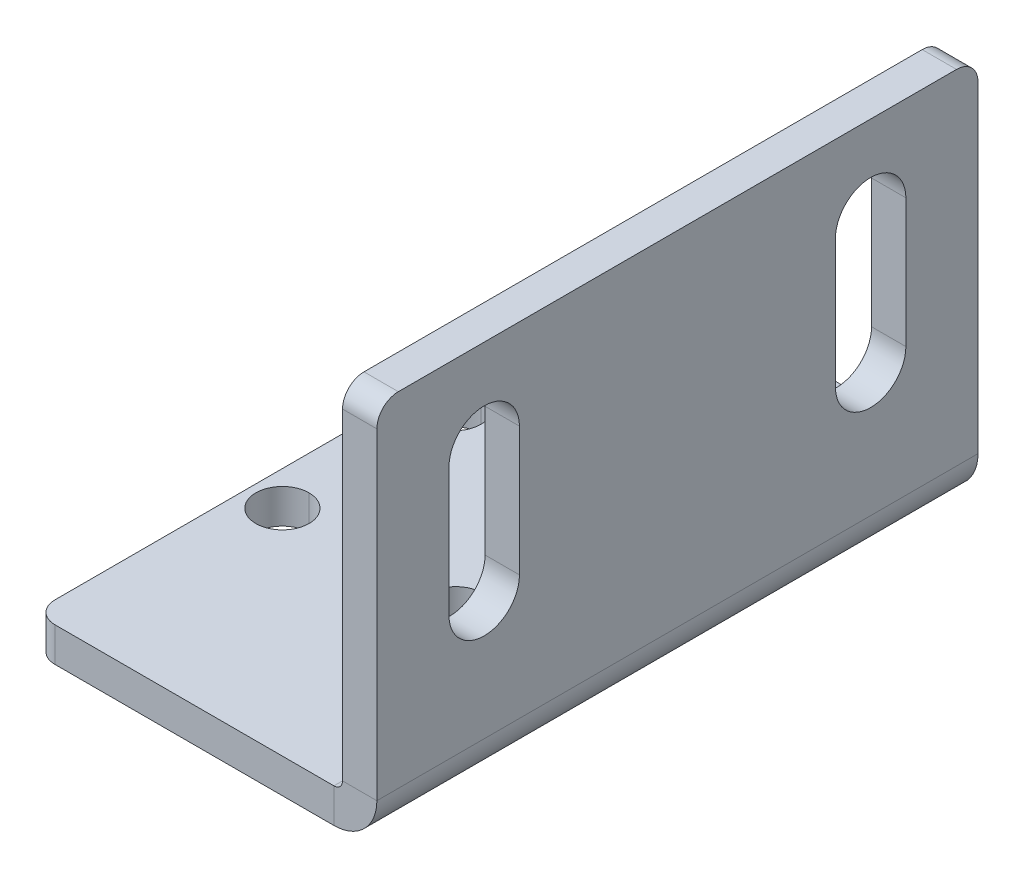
ISO-10303-21;
HEADER;
FILE_DESCRIPTION(('STEP AP214'),'2;1');
FILE_NAME('part.step','',(''),(''),'','','');
FILE_SCHEMA(('AUTOMOTIVE_DESIGN { 1 0 10303 214 1 1 1 1 }'));
ENDSEC;
DATA;
#1=APPLICATION_CONTEXT('core data for automotive mechanical design processes');
#2=APPLICATION_PROTOCOL_DEFINITION('international standard','automotive_design',2000,#1);
#3=PRODUCT_CONTEXT('',#1,'mechanical');
#4=PRODUCT('Part','Part','',(#3));
#5=PRODUCT_RELATED_PRODUCT_CATEGORY('part','',(#4));
#6=PRODUCT_DEFINITION_FORMATION('','',#4);
#7=PRODUCT_DEFINITION_CONTEXT('part definition',#1,'design');
#8=PRODUCT_DEFINITION('design','',#6,#7);
#9=PRODUCT_DEFINITION_SHAPE('','',#8);
#10=(LENGTH_UNIT() NAMED_UNIT(*) SI_UNIT(.MILLI.,.METRE.));
#11=(NAMED_UNIT(*) PLANE_ANGLE_UNIT() SI_UNIT($,.RADIAN.));
#12=(NAMED_UNIT(*) SI_UNIT($,.STERADIAN.) SOLID_ANGLE_UNIT());
#13=UNCERTAINTY_MEASURE_WITH_UNIT(LENGTH_MEASURE(1.E-05),#10,'distance_accuracy_value','');
#14=(GEOMETRIC_REPRESENTATION_CONTEXT(3) GLOBAL_UNCERTAINTY_ASSIGNED_CONTEXT((#13)) GLOBAL_UNIT_ASSIGNED_CONTEXT((#10,
#11,#12)) REPRESENTATION_CONTEXT('',''));
#15=CARTESIAN_POINT('',(0.,0.,0.));
#16=DIRECTION('',(0.,0.,1.));
#17=DIRECTION('',(1.,0.,0.));
#18=AXIS2_PLACEMENT_3D('',#15,#16,#17);
#19=CARTESIAN_POINT('',(-16.,4.,10.));
#20=DIRECTION('',(0.,1.,0.));
#21=DIRECTION('',(0.,0.,1.));
#22=AXIS2_PLACEMENT_3D('',#19,#20,#21);
#23=CYLINDRICAL_SURFACE('',#22,3.1);
#24=DIRECTION('',(0.,1.,0.));
#25=VECTOR('',#24,1.);
#26=CARTESIAN_POINT('',(-16.,4.,6.9));
#27=LINE('',#26,#25);
#28=CARTESIAN_POINT('',(-16.,0.,6.9));
#29=VERTEX_POINT('',#28);
#30=CARTESIAN_POINT('',(-16.,4.,6.9));
#31=VERTEX_POINT('',#30);
#32=EDGE_CURVE('E385',#29,#31,#27,.T.);
#33=ORIENTED_EDGE('',*,*,#32,.F.);
#34=CARTESIAN_POINT('',(-16.,0.,10.));
#35=DIRECTION('',(0.,1.,0.));
#36=DIRECTION('',(0.,0.,1.));
#37=AXIS2_PLACEMENT_3D('',#34,#35,#36);
#38=CIRCLE('',#37,3.1);
#39=CARTESIAN_POINT('',(-16.,0.,13.1));
#40=VERTEX_POINT('',#39);
#41=EDGE_CURVE('E500',#40,#29,#38,.T.);
#42=ORIENTED_EDGE('',*,*,#41,.F.);
#43=DIRECTION('',(0.,1.,0.));
#44=VECTOR('',#43,1.);
#45=CARTESIAN_POINT('',(-16.,4.,13.1));
#46=LINE('',#45,#44);
#47=CARTESIAN_POINT('',(-16.,4.,13.1));
#48=VERTEX_POINT('',#47);
#49=EDGE_CURVE('E393',#40,#48,#46,.T.);
#50=ORIENTED_EDGE('',*,*,#49,.T.);
#51=CARTESIAN_POINT('',(-16.,4.,10.));
#52=DIRECTION('',(0.,1.,0.));
#53=DIRECTION('',(0.,0.,1.));
#54=AXIS2_PLACEMENT_3D('',#51,#52,#53);
#55=CIRCLE('',#54,3.1);
#56=EDGE_CURVE('E483',#48,#31,#55,.T.);
#57=ORIENTED_EDGE('',*,*,#56,.T.);
#58=EDGE_LOOP('',(#33,#42,#50,#57));
#59=FACE_BOUND('',#58,.T.);
#60=ADVANCED_FACE('F51',(#59),#23,.F.);
#61=CARTESIAN_POINT('',(4.2,4.,10.));
#62=DIRECTION('',(0.,1.,0.));
#63=DIRECTION('',(0.,0.,1.));
#64=AXIS2_PLACEMENT_3D('',#61,#62,#63);
#65=CYLINDRICAL_SURFACE('',#64,3.1);
#66=DIRECTION('',(0.,1.,0.));
#67=VECTOR('',#66,1.);
#68=CARTESIAN_POINT('',(4.2,4.,6.9));
#69=LINE('',#68,#67);
#70=CARTESIAN_POINT('',(4.2,0.,6.9));
#71=VERTEX_POINT('',#70);
#72=CARTESIAN_POINT('',(4.2,4.,6.9));
#73=VERTEX_POINT('',#72);
#74=EDGE_CURVE('E411',#71,#73,#69,.T.);
#75=ORIENTED_EDGE('',*,*,#74,.F.);
#76=CARTESIAN_POINT('',(4.2,0.,10.));
#77=DIRECTION('',(0.,1.,0.));
#78=DIRECTION('',(0.,0.,1.));
#79=AXIS2_PLACEMENT_3D('',#76,#77,#78);
#80=CIRCLE('',#79,3.1);
#81=CARTESIAN_POINT('',(4.2,0.,13.1));
#82=VERTEX_POINT('',#81);
#83=EDGE_CURVE('E503',#82,#71,#80,.T.);
#84=ORIENTED_EDGE('',*,*,#83,.F.);
#85=DIRECTION('',(0.,1.,0.));
#86=VECTOR('',#85,1.);
#87=CARTESIAN_POINT('',(4.2,4.,13.1));
#88=LINE('',#87,#86);
#89=CARTESIAN_POINT('',(4.2,4.,13.1));
#90=VERTEX_POINT('',#89);
#91=EDGE_CURVE('E363',#82,#90,#88,.T.);
#92=ORIENTED_EDGE('',*,*,#91,.T.);
#93=CARTESIAN_POINT('',(4.2,4.,10.));
#94=DIRECTION('',(0.,1.,0.));
#95=DIRECTION('',(0.,0.,1.));
#96=AXIS2_PLACEMENT_3D('',#93,#94,#95);
#97=CIRCLE('',#96,3.1);
#98=EDGE_CURVE('E486',#90,#73,#97,.T.);
#99=ORIENTED_EDGE('',*,*,#98,.T.);
#100=EDGE_LOOP('',(#75,#84,#92,#99));
#101=FACE_BOUND('',#100,.T.);
#102=ADVANCED_FACE('F651',(#101),#65,.F.);
#103=CARTESIAN_POINT('',(-16.,4.,-10.));
#104=DIRECTION('',(0.,1.,0.));
#105=DIRECTION('',(0.,0.,1.));
#106=AXIS2_PLACEMENT_3D('',#103,#104,#105);
#107=CYLINDRICAL_SURFACE('',#106,3.1);
#108=DIRECTION('',(0.,1.,0.));
#109=VECTOR('',#108,1.);
#110=CARTESIAN_POINT('',(-16.,4.,-13.1));
#111=LINE('',#110,#109);
#112=CARTESIAN_POINT('',(-16.,0.,-13.1));
#113=VERTEX_POINT('',#112);
#114=CARTESIAN_POINT('',(-16.,4.,-13.1));
#115=VERTEX_POINT('',#114);
#116=EDGE_CURVE('E424',#113,#115,#111,.T.);
#117=ORIENTED_EDGE('',*,*,#116,.F.);
#118=CARTESIAN_POINT('',(-16.,0.,-10.));
#119=DIRECTION('',(0.,1.,0.));
#120=DIRECTION('',(0.,0.,1.));
#121=AXIS2_PLACEMENT_3D('',#118,#119,#120);
#122=CIRCLE('',#121,3.1);
#123=CARTESIAN_POINT('',(-16.,0.,-6.9));
#124=VERTEX_POINT('',#123);
#125=EDGE_CURVE('E506',#124,#113,#122,.T.);
#126=ORIENTED_EDGE('',*,*,#125,.F.);
#127=DIRECTION('',(0.,1.,0.));
#128=VECTOR('',#127,1.);
#129=CARTESIAN_POINT('',(-16.,4.,-6.9));
#130=LINE('',#129,#128);
#131=CARTESIAN_POINT('',(-16.,4.,-6.9));
#132=VERTEX_POINT('',#131);
#133=EDGE_CURVE('E410',#124,#132,#130,.T.);
#134=ORIENTED_EDGE('',*,*,#133,.T.);
#135=CARTESIAN_POINT('',(-16.,4.,-10.));
#136=DIRECTION('',(0.,1.,0.));
#137=DIRECTION('',(0.,0.,1.));
#138=AXIS2_PLACEMENT_3D('',#135,#136,#137);
#139=CIRCLE('',#138,3.1);
#140=EDGE_CURVE('E401',#132,#115,#139,.T.);
#141=ORIENTED_EDGE('',*,*,#140,.T.);
#142=EDGE_LOOP('',(#117,#126,#134,#141));
#143=FACE_BOUND('',#142,.T.);
#144=ADVANCED_FACE('F647',(#143),#107,.F.);
#145=CARTESIAN_POINT('',(4.2,4.,-10.));
#146=DIRECTION('',(0.,1.,0.));
#147=DIRECTION('',(0.,0.,1.));
#148=AXIS2_PLACEMENT_3D('',#145,#146,#147);
#149=CYLINDRICAL_SURFACE('',#148,3.1);
#150=DIRECTION('',(0.,1.,0.));
#151=VECTOR('',#150,1.);
#152=CARTESIAN_POINT('',(4.2,4.,-13.1));
#153=LINE('',#152,#151);
#154=CARTESIAN_POINT('',(4.2,0.,-13.1));
#155=VERTEX_POINT('',#154);
#156=CARTESIAN_POINT('',(4.2,4.,-13.1));
#157=VERTEX_POINT('',#156);
#158=EDGE_CURVE('E409',#155,#157,#153,.T.);
#159=ORIENTED_EDGE('',*,*,#158,.F.);
#160=CARTESIAN_POINT('',(4.2,0.,-10.));
#161=DIRECTION('',(0.,1.,0.));
#162=DIRECTION('',(0.,0.,1.));
#163=AXIS2_PLACEMENT_3D('',#160,#161,#162);
#164=CIRCLE('',#163,3.1);
#165=CARTESIAN_POINT('',(4.2,0.,-6.9));
#166=VERTEX_POINT('',#165);
#167=EDGE_CURVE('E509',#166,#155,#164,.T.);
#168=ORIENTED_EDGE('',*,*,#167,.F.);
#169=DIRECTION('',(0.,1.,0.));
#170=VECTOR('',#169,1.);
#171=CARTESIAN_POINT('',(4.2,4.,-6.9));
#172=LINE('',#171,#170);
#173=CARTESIAN_POINT('',(4.2,4.,-6.9));
#174=VERTEX_POINT('',#173);
#175=EDGE_CURVE('E451',#166,#174,#172,.T.);
#176=ORIENTED_EDGE('',*,*,#175,.T.);
#177=CARTESIAN_POINT('',(4.2,4.,-10.));
#178=DIRECTION('',(0.,1.,0.));
#179=DIRECTION('',(0.,0.,1.));
#180=AXIS2_PLACEMENT_3D('',#177,#178,#179);
#181=CIRCLE('',#180,3.1);
#182=EDGE_CURVE('E398',#174,#157,#181,.T.);
#183=ORIENTED_EDGE('',*,*,#182,.T.);
#184=EDGE_LOOP('',(#159,#168,#176,#183));
#185=FACE_BOUND('',#184,.T.);
#186=ADVANCED_FACE('F640',(#185),#149,.F.);
#187=CARTESIAN_POINT('',(-17.5,4.,32.5));
#188=DIRECTION('',(0.,1.,0.));
#189=DIRECTION('',(0.,0.,1.));
#190=AXIS2_PLACEMENT_3D('',#187,#188,#189);
#191=CYLINDRICAL_SURFACE('',#190,2.5);
#192=CARTESIAN_POINT('',(-17.5,0.,32.5));
#193=DIRECTION('',(0.,-1.,0.));
#194=DIRECTION('',(0.,0.,1.));
#195=AXIS2_PLACEMENT_3D('',#192,#193,#194);
#196=CIRCLE('',#195,2.5);
#197=CARTESIAN_POINT('',(-17.5,0.,35.));
#198=VERTEX_POINT('',#197);
#199=CARTESIAN_POINT('',(-20.,0.,32.5));
#200=VERTEX_POINT('',#199);
#201=EDGE_CURVE('E379',#198,#200,#196,.T.);
#202=ORIENTED_EDGE('',*,*,#201,.F.);
#203=DIRECTION('',(0.,-1.,0.));
#204=VECTOR('',#203,1.);
#205=CARTESIAN_POINT('',(-17.5,4.,35.));
#206=LINE('',#205,#204);
#207=CARTESIAN_POINT('',(-17.5,4.,35.));
#208=VERTEX_POINT('',#207);
#209=EDGE_CURVE('E518',#208,#198,#206,.T.);
#210=ORIENTED_EDGE('',*,*,#209,.F.);
#211=CARTESIAN_POINT('',(-17.5,4.,32.5));
#212=DIRECTION('',(0.,1.,0.));
#213=DIRECTION('',(0.,0.,1.));
#214=AXIS2_PLACEMENT_3D('',#211,#212,#213);
#215=CIRCLE('',#214,2.5);
#216=CARTESIAN_POINT('',(-20.,4.,32.5));
#217=VERTEX_POINT('',#216);
#218=EDGE_CURVE('E440',#217,#208,#215,.T.);
#219=ORIENTED_EDGE('',*,*,#218,.F.);
#220=DIRECTION('',(0.,1.,0.));
#221=VECTOR('',#220,1.);
#222=CARTESIAN_POINT('',(-20.,4.,32.5));
#223=LINE('',#222,#221);
#224=EDGE_CURVE('E515',#200,#217,#223,.T.);
#225=ORIENTED_EDGE('',*,*,#224,.F.);
#226=EDGE_LOOP('',(#202,#210,#219,#225));
#227=FACE_BOUND('',#226,.T.);
#228=ADVANCED_FACE('F638',(#227),#191,.T.);
#229=CARTESIAN_POINT('',(-17.5,4.,-32.5));
#230=DIRECTION('',(0.,1.,0.));
#231=DIRECTION('',(0.,0.,1.));
#232=AXIS2_PLACEMENT_3D('',#229,#230,#231);
#233=CYLINDRICAL_SURFACE('',#232,2.5);
#234=CARTESIAN_POINT('',(-17.5,0.,-32.5));
#235=DIRECTION('',(0.,-1.,0.));
#236=DIRECTION('',(0.,0.,1.));
#237=AXIS2_PLACEMENT_3D('',#234,#235,#236);
#238=CIRCLE('',#237,2.5);
#239=CARTESIAN_POINT('',(-20.,0.,-32.5));
#240=VERTEX_POINT('',#239);
#241=CARTESIAN_POINT('',(-17.5,0.,-35.));
#242=VERTEX_POINT('',#241);
#243=EDGE_CURVE('E381',#240,#242,#238,.T.);
#244=ORIENTED_EDGE('',*,*,#243,.F.);
#245=DIRECTION('',(0.,-1.,0.));
#246=VECTOR('',#245,1.);
#247=CARTESIAN_POINT('',(-20.,4.,-32.5));
#248=LINE('',#247,#246);
#249=CARTESIAN_POINT('',(-20.,4.,-32.5));
#250=VERTEX_POINT('',#249);
#251=EDGE_CURVE('E512',#250,#240,#248,.T.);
#252=ORIENTED_EDGE('',*,*,#251,.F.);
#253=CARTESIAN_POINT('',(-17.5,4.,-32.5));
#254=DIRECTION('',(0.,1.,0.));
#255=DIRECTION('',(0.,0.,1.));
#256=AXIS2_PLACEMENT_3D('',#253,#254,#255);
#257=CIRCLE('',#256,2.5);
#258=CARTESIAN_POINT('',(-17.5,4.,-35.));
#259=VERTEX_POINT('',#258);
#260=EDGE_CURVE('E441',#259,#250,#257,.T.);
#261=ORIENTED_EDGE('',*,*,#260,.F.);
#262=DIRECTION('',(0.,1.,0.));
#263=VECTOR('',#262,1.);
#264=CARTESIAN_POINT('',(-17.5,4.,-35.));
#265=LINE('',#264,#263);
#266=EDGE_CURVE('E362',#242,#259,#265,.T.);
#267=ORIENTED_EDGE('',*,*,#266,.F.);
#268=EDGE_LOOP('',(#244,#252,#261,#267));
#269=FACE_BOUND('',#268,.T.);
#270=ADVANCED_FACE('F633',(#269),#233,.T.);
#271=CARTESIAN_POINT('',(20.,42.5,-32.5));
#272=DIRECTION('',(-1.,0.,0.));
#273=DIRECTION('',(0.,-1.,0.));
#274=AXIS2_PLACEMENT_3D('',#271,#272,#273);
#275=CYLINDRICAL_SURFACE('',#274,2.5);
#276=CARTESIAN_POINT('',(20.,42.5,-32.5));
#277=DIRECTION('',(1.,0.,0.));
#278=DIRECTION('',(0.,-1.,0.));
#279=AXIS2_PLACEMENT_3D('',#276,#277,#278);
#280=CIRCLE('',#279,2.5);
#281=CARTESIAN_POINT('',(20.,42.5,-35.));
#282=VERTEX_POINT('',#281);
#283=CARTESIAN_POINT('',(20.,45.,-32.5));
#284=VERTEX_POINT('',#283);
#285=EDGE_CURVE('E351',#282,#284,#280,.T.);
#286=ORIENTED_EDGE('',*,*,#285,.F.);
#287=DIRECTION('',(1.,0.,0.));
#288=VECTOR('',#287,1.);
#289=CARTESIAN_POINT('',(20.,42.5,-35.));
#290=LINE('',#289,#288);
#291=CARTESIAN_POINT('',(16.,42.5,-35.));
#292=VERTEX_POINT('',#291);
#293=EDGE_CURVE('E373',#292,#282,#290,.T.);
#294=ORIENTED_EDGE('',*,*,#293,.F.);
#295=CARTESIAN_POINT('',(16.,42.5,-32.5));
#296=DIRECTION('',(-1.,0.,0.));
#297=DIRECTION('',(0.,-1.,0.));
#298=AXIS2_PLACEMENT_3D('',#295,#296,#297);
#299=CIRCLE('',#298,2.5);
#300=CARTESIAN_POINT('',(16.,45.,-32.5));
#301=VERTEX_POINT('',#300);
#302=EDGE_CURVE('E458',#301,#292,#299,.T.);
#303=ORIENTED_EDGE('',*,*,#302,.F.);
#304=DIRECTION('',(-1.,0.,0.));
#305=VECTOR('',#304,1.);
#306=CARTESIAN_POINT('',(20.,45.,-32.5));
#307=LINE('',#306,#305);
#308=EDGE_CURVE('E11',#284,#301,#307,.T.);
#309=ORIENTED_EDGE('',*,*,#308,.F.);
#310=EDGE_LOOP('',(#286,#294,#303,#309));
#311=FACE_BOUND('',#310,.T.);
#312=ADVANCED_FACE('F584',(#311),#275,.T.);
#313=CARTESIAN_POINT('',(20.,42.5,32.5));
#314=DIRECTION('',(-1.,0.,0.));
#315=DIRECTION('',(0.,-1.,0.));
#316=AXIS2_PLACEMENT_3D('',#313,#314,#315);
#317=CYLINDRICAL_SURFACE('',#316,2.5);
#318=CARTESIAN_POINT('',(20.,42.5,32.5));
#319=DIRECTION('',(1.,0.,0.));
#320=DIRECTION('',(0.,-1.,0.));
#321=AXIS2_PLACEMENT_3D('',#318,#319,#320);
#322=CIRCLE('',#321,2.5);
#323=CARTESIAN_POINT('',(20.,45.,32.5));
#324=VERTEX_POINT('',#323);
#325=CARTESIAN_POINT('',(20.,42.5,35.));
#326=VERTEX_POINT('',#325);
#327=EDGE_CURVE('E356',#324,#326,#322,.T.);
#328=ORIENTED_EDGE('',*,*,#327,.F.);
#329=DIRECTION('',(1.,0.,0.));
#330=VECTOR('',#329,1.);
#331=CARTESIAN_POINT('',(20.,45.,32.5));
#332=LINE('',#331,#330);
#333=CARTESIAN_POINT('',(16.,45.,32.5));
#334=VERTEX_POINT('',#333);
#335=EDGE_CURVE('E59',#334,#324,#332,.T.);
#336=ORIENTED_EDGE('',*,*,#335,.F.);
#337=CARTESIAN_POINT('',(16.,42.5,32.5));
#338=DIRECTION('',(-1.,0.,0.));
#339=DIRECTION('',(0.,-1.,0.));
#340=AXIS2_PLACEMENT_3D('',#337,#338,#339);
#341=CIRCLE('',#340,2.5);
#342=CARTESIAN_POINT('',(16.,42.5,35.));
#343=VERTEX_POINT('',#342);
#344=EDGE_CURVE('E355',#343,#334,#341,.T.);
#345=ORIENTED_EDGE('',*,*,#344,.F.);
#346=DIRECTION('',(-1.,0.,0.));
#347=VECTOR('',#346,1.);
#348=CARTESIAN_POINT('',(20.,42.5,35.));
#349=LINE('',#348,#347);
#350=EDGE_CURVE('E565',#326,#343,#349,.T.);
#351=ORIENTED_EDGE('',*,*,#350,.F.);
#352=EDGE_LOOP('',(#328,#336,#345,#351));
#353=FACE_BOUND('',#352,.T.);
#354=ADVANCED_FACE('F615',(#353),#317,.T.);
#355=CARTESIAN_POINT('',(20.,45.,35.));
#356=DIRECTION('',(0.,-1.,0.));
#357=DIRECTION('',(-1.,0.,0.));
#358=AXIS2_PLACEMENT_3D('',#355,#356,#357);
#359=PLANE('',#358);
#360=DIRECTION('',(0.,0.,1.));
#361=VECTOR('',#360,1.);
#362=CARTESIAN_POINT('',(16.,45.,35.));
#363=LINE('',#362,#361);
#364=EDGE_CURVE('E462',#301,#334,#363,.T.);
#365=ORIENTED_EDGE('',*,*,#364,.T.);
#366=ORIENTED_EDGE('',*,*,#335,.T.);
#367=DIRECTION('',(0.,0.,1.));
#368=VECTOR('',#367,1.);
#369=CARTESIAN_POINT('',(20.,45.,0.));
#370=LINE('',#369,#368);
#371=EDGE_CURVE('E545',#284,#324,#370,.T.);
#372=ORIENTED_EDGE('',*,*,#371,.F.);
#373=ORIENTED_EDGE('',*,*,#308,.T.);
#374=EDGE_LOOP('',(#365,#366,#372,#373));
#375=FACE_BOUND('',#374,.T.);
#376=ADVANCED_FACE('F618',(#375),#359,.F.);
#377=CARTESIAN_POINT('',(16.,0.,0.));
#378=DIRECTION('',(-1.,0.,0.));
#379=DIRECTION('',(0.,0.,1.));
#380=AXIS2_PLACEMENT_3D('',#377,#378,#379);
#381=PLANE('',#380);
#382=CARTESIAN_POINT('',(16.0000000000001,20.,-22.5));
#383=DIRECTION('',(-1.,0.,0.));
#384=DIRECTION('',(0.,-1.,0.));
#385=AXIS2_PLACEMENT_3D('',#382,#383,#384);
#386=CIRCLE('',#385,4.1);
#387=CARTESIAN_POINT('',(16.0000000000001,20.,-26.6));
#388=VERTEX_POINT('',#387);
#389=CARTESIAN_POINT('',(16.0000000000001,20.,-18.4));
#390=VERTEX_POINT('',#389);
#391=EDGE_CURVE('E280',#388,#390,#386,.T.);
#392=ORIENTED_EDGE('',*,*,#391,.F.);
#393=DIRECTION('',(0.,-1.,0.));
#394=VECTOR('',#393,1.);
#395=CARTESIAN_POINT('',(16.0000000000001,35.,-26.6));
#396=LINE('',#395,#394);
#397=CARTESIAN_POINT('',(16.0000000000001,35.,-26.6));
#398=VERTEX_POINT('',#397);
#399=EDGE_CURVE('E298',#398,#388,#396,.T.);
#400=ORIENTED_EDGE('',*,*,#399,.F.);
#401=CARTESIAN_POINT('',(16.0000000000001,35.,-22.5));
#402=DIRECTION('',(-1.,0.,0.));
#403=DIRECTION('',(0.,-1.,0.));
#404=AXIS2_PLACEMENT_3D('',#401,#402,#403);
#405=CIRCLE('',#404,4.1);
#406=CARTESIAN_POINT('',(16.0000000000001,35.,-18.4));
#407=VERTEX_POINT('',#406);
#408=EDGE_CURVE('E305',#407,#398,#405,.T.);
#409=ORIENTED_EDGE('',*,*,#408,.F.);
#410=DIRECTION('',(0.,1.,0.));
#411=VECTOR('',#410,1.);
#412=CARTESIAN_POINT('',(16.0000000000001,20.,-18.4));
#413=LINE('',#412,#411);
#414=EDGE_CURVE('E303',#390,#407,#413,.T.);
#415=ORIENTED_EDGE('',*,*,#414,.F.);
#416=EDGE_LOOP('',(#392,#400,#409,#415));
#417=FACE_BOUND('',#416,.T.);
#418=CARTESIAN_POINT('',(16.0000000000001,19.4765675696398,22.5));
#419=DIRECTION('',(-1.,0.,0.));
#420=DIRECTION('',(0.,-1.,0.));
#421=AXIS2_PLACEMENT_3D('',#418,#419,#420);
#422=CIRCLE('',#421,4.1);
#423=CARTESIAN_POINT('',(16.0000000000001,19.4765675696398,18.4));
#424=VERTEX_POINT('',#423);
#425=CARTESIAN_POINT('',(16.0000000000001,19.4765675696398,26.6));
#426=VERTEX_POINT('',#425);
#427=EDGE_CURVE('E325',#424,#426,#422,.T.);
#428=ORIENTED_EDGE('',*,*,#427,.F.);
#429=DIRECTION('',(0.,-1.,0.));
#430=VECTOR('',#429,1.);
#431=CARTESIAN_POINT('',(16.0000000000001,34.4765675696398,18.4));
#432=LINE('',#431,#430);
#433=CARTESIAN_POINT('',(16.0000000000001,34.4765675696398,18.4));
#434=VERTEX_POINT('',#433);
#435=EDGE_CURVE('E327',#434,#424,#432,.T.);
#436=ORIENTED_EDGE('',*,*,#435,.F.);
#437=CARTESIAN_POINT('',(16.0000000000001,34.4765675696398,22.5));
#438=DIRECTION('',(-1.,0.,0.));
#439=DIRECTION('',(0.,-1.,0.));
#440=AXIS2_PLACEMENT_3D('',#437,#438,#439);
#441=CIRCLE('',#440,4.1);
#442=CARTESIAN_POINT('',(16.0000000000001,34.4765675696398,26.6));
#443=VERTEX_POINT('',#442);
#444=EDGE_CURVE('E331',#443,#434,#441,.T.);
#445=ORIENTED_EDGE('',*,*,#444,.F.);
#446=DIRECTION('',(0.,1.,0.));
#447=VECTOR('',#446,1.);
#448=CARTESIAN_POINT('',(16.0000000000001,19.4765675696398,26.6));
#449=LINE('',#448,#447);
#450=EDGE_CURVE('E306',#426,#443,#449,.T.);
#451=ORIENTED_EDGE('',*,*,#450,.F.);
#452=EDGE_LOOP('',(#428,#436,#445,#451));
#453=FACE_BOUND('',#452,.T.);
#454=DIRECTION('',(0.,-1.,0.));
#455=VECTOR('',#454,1.);
#456=CARTESIAN_POINT('',(16.,4.,35.));
#457=LINE('',#456,#455);
#458=CARTESIAN_POINT('',(16.,5.,35.));
#459=VERTEX_POINT('',#458);
#460=EDGE_CURVE('E549',#343,#459,#457,.T.);
#461=ORIENTED_EDGE('',*,*,#460,.F.);
#462=ORIENTED_EDGE('',*,*,#344,.T.);
#463=ORIENTED_EDGE('',*,*,#364,.F.);
#464=ORIENTED_EDGE('',*,*,#302,.T.);
#465=DIRECTION('',(0.,1.,0.));
#466=VECTOR('',#465,1.);
#467=CARTESIAN_POINT('',(16.,45.,-35.));
#468=LINE('',#467,#466);
#469=CARTESIAN_POINT('',(16.,5.,-35.));
#470=VERTEX_POINT('',#469);
#471=EDGE_CURVE('E369',#470,#292,#468,.T.);
#472=ORIENTED_EDGE('',*,*,#471,.F.);
#473=DIRECTION('',(0.,0.,-1.));
#474=VECTOR('',#473,1.);
#475=CARTESIAN_POINT('',(16.,5.,35.));
#476=LINE('',#475,#474);
#477=EDGE_CURVE('E374',#459,#470,#476,.T.);
#478=ORIENTED_EDGE('',*,*,#477,.F.);
#479=EDGE_LOOP('',(#461,#462,#463,#464,#472,#478));
#480=FACE_BOUND('',#479,.T.);
#481=ADVANCED_FACE('F581',(#417,#453,#480),#381,.T.);
#482=CARTESIAN_POINT('',(20.,0.,0.));
#483=DIRECTION('',(-1.,0.,0.));
#484=DIRECTION('',(0.,0.,1.));
#485=AXIS2_PLACEMENT_3D('',#482,#483,#484);
#486=PLANE('',#485);
#487=DIRECTION('',(0.,-1.,0.));
#488=VECTOR('',#487,1.);
#489=CARTESIAN_POINT('',(20.0000000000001,35.,-26.6));
#490=LINE('',#489,#488);
#491=CARTESIAN_POINT('',(20.0000000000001,35.,-26.6));
#492=VERTEX_POINT('',#491);
#493=CARTESIAN_POINT('',(20.0000000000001,20.,-26.6));
#494=VERTEX_POINT('',#493);
#495=EDGE_CURVE('E283',#492,#494,#490,.T.);
#496=ORIENTED_EDGE('',*,*,#495,.T.);
#497=CARTESIAN_POINT('',(20.0000000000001,20.,-22.5));
#498=DIRECTION('',(-1.,0.,0.));
#499=DIRECTION('',(0.,-1.,0.));
#500=AXIS2_PLACEMENT_3D('',#497,#498,#499);
#501=CIRCLE('',#500,4.1);
#502=CARTESIAN_POINT('',(20.0000000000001,20.,-18.4));
#503=VERTEX_POINT('',#502);
#504=EDGE_CURVE('E277',#494,#503,#501,.T.);
#505=ORIENTED_EDGE('',*,*,#504,.T.);
#506=DIRECTION('',(0.,1.,0.));
#507=VECTOR('',#506,1.);
#508=CARTESIAN_POINT('',(20.0000000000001,20.,-18.4));
#509=LINE('',#508,#507);
#510=CARTESIAN_POINT('',(20.0000000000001,35.,-18.4));
#511=VERTEX_POINT('',#510);
#512=EDGE_CURVE('E287',#503,#511,#509,.T.);
#513=ORIENTED_EDGE('',*,*,#512,.T.);
#514=CARTESIAN_POINT('',(20.0000000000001,35.,-22.5));
#515=DIRECTION('',(-1.,0.,0.));
#516=DIRECTION('',(0.,-1.,0.));
#517=AXIS2_PLACEMENT_3D('',#514,#515,#516);
#518=CIRCLE('',#517,4.1);
#519=EDGE_CURVE('E291',#511,#492,#518,.T.);
#520=ORIENTED_EDGE('',*,*,#519,.T.);
#521=EDGE_LOOP('',(#496,#505,#513,#520));
#522=FACE_BOUND('',#521,.T.);
#523=DIRECTION('',(0.,-1.,0.));
#524=VECTOR('',#523,1.);
#525=CARTESIAN_POINT('',(20.0000000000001,34.4765675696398,18.4));
#526=LINE('',#525,#524);
#527=CARTESIAN_POINT('',(20.0000000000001,34.4765675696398,18.4));
#528=VERTEX_POINT('',#527);
#529=CARTESIAN_POINT('',(20.0000000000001,19.4765675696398,18.4));
#530=VERTEX_POINT('',#529);
#531=EDGE_CURVE('E318',#528,#530,#526,.T.);
#532=ORIENTED_EDGE('',*,*,#531,.T.);
#533=CARTESIAN_POINT('',(20.0000000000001,19.4765675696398,22.5));
#534=DIRECTION('',(-1.,0.,0.));
#535=DIRECTION('',(0.,-1.,0.));
#536=AXIS2_PLACEMENT_3D('',#533,#534,#535);
#537=CIRCLE('',#536,4.1);
#538=CARTESIAN_POINT('',(20.0000000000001,19.4765675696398,26.6));
#539=VERTEX_POINT('',#538);
#540=EDGE_CURVE('E328',#530,#539,#537,.T.);
#541=ORIENTED_EDGE('',*,*,#540,.T.);
#542=DIRECTION('',(0.,1.,0.));
#543=VECTOR('',#542,1.);
#544=CARTESIAN_POINT('',(20.0000000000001,19.4765675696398,26.6));
#545=LINE('',#544,#543);
#546=CARTESIAN_POINT('',(20.0000000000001,34.4765675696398,26.6));
#547=VERTEX_POINT('',#546);
#548=EDGE_CURVE('E340',#539,#547,#545,.T.);
#549=ORIENTED_EDGE('',*,*,#548,.T.);
#550=CARTESIAN_POINT('',(20.0000000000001,34.4765675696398,22.5));
#551=DIRECTION('',(-1.,0.,0.));
#552=DIRECTION('',(0.,-1.,0.));
#553=AXIS2_PLACEMENT_3D('',#550,#551,#552);
#554=CIRCLE('',#553,4.1);
#555=EDGE_CURVE('E337',#547,#528,#554,.T.);
#556=ORIENTED_EDGE('',*,*,#555,.T.);
#557=EDGE_LOOP('',(#532,#541,#549,#556));
#558=FACE_BOUND('',#557,.T.);
#559=ORIENTED_EDGE('',*,*,#371,.T.);
#560=ORIENTED_EDGE('',*,*,#327,.T.);
#561=DIRECTION('',(0.,-1.,0.));
#562=VECTOR('',#561,1.);
#563=CARTESIAN_POINT('',(20.,0.,35.));
#564=LINE('',#563,#562);
#565=CARTESIAN_POINT('',(20.,5.,35.));
#566=VERTEX_POINT('',#565);
#567=EDGE_CURVE('E560',#326,#566,#564,.T.);
#568=ORIENTED_EDGE('',*,*,#567,.T.);
#569=DIRECTION('',(0.,0.,1.));
#570=VECTOR('',#569,1.);
#571=CARTESIAN_POINT('',(20.,5.,35.));
#572=LINE('',#571,#570);
#573=CARTESIAN_POINT('',(20.,5.,-35.));
#574=VERTEX_POINT('',#573);
#575=EDGE_CURVE('E541',#574,#566,#572,.T.);
#576=ORIENTED_EDGE('',*,*,#575,.F.);
#577=DIRECTION('',(0.,1.,0.));
#578=VECTOR('',#577,1.);
#579=CARTESIAN_POINT('',(20.,0.,-35.));
#580=LINE('',#579,#578);
#581=EDGE_CURVE('E556',#574,#282,#580,.T.);
#582=ORIENTED_EDGE('',*,*,#581,.T.);
#583=ORIENTED_EDGE('',*,*,#285,.T.);
#584=EDGE_LOOP('',(#559,#560,#568,#576,#582,#583));
#585=FACE_BOUND('',#584,.T.);
#586=ADVANCED_FACE('F294',(#522,#558,#585),#486,.F.);
#587=CARTESIAN_POINT('',(20.,4.,35.));
#588=DIRECTION('',(0.,0.,-1.));
#589=DIRECTION('',(0.,-1.,0.));
#590=AXIS2_PLACEMENT_3D('',#587,#588,#589);
#591=PLANE('',#590);
#592=ORIENTED_EDGE('',*,*,#567,.F.);
#593=ORIENTED_EDGE('',*,*,#350,.T.);
#594=ORIENTED_EDGE('',*,*,#460,.T.);
#595=DIRECTION('',(1.,0.,0.));
#596=VECTOR('',#595,1.);
#597=CARTESIAN_POINT('',(20.,5.,35.));
#598=LINE('',#597,#596);
#599=EDGE_CURVE('E525',#459,#566,#598,.T.);
#600=ORIENTED_EDGE('',*,*,#599,.T.);
#601=EDGE_LOOP('',(#592,#593,#594,#600));
#602=FACE_BOUND('',#601,.T.);
#603=ADVANCED_FACE('F611',(#602),#591,.F.);
#604=CARTESIAN_POINT('',(20.,45.,-35.));
#605=DIRECTION('',(0.,0.,1.));
#606=DIRECTION('',(0.,-1.,0.));
#607=AXIS2_PLACEMENT_3D('',#604,#605,#606);
#608=PLANE('',#607);
#609=ORIENTED_EDGE('',*,*,#471,.T.);
#610=ORIENTED_EDGE('',*,*,#293,.T.);
#611=ORIENTED_EDGE('',*,*,#581,.F.);
#612=DIRECTION('',(1.,0.,0.));
#613=VECTOR('',#612,1.);
#614=CARTESIAN_POINT('',(16.,5.,-35.));
#615=LINE('',#614,#613);
#616=EDGE_CURVE('E534',#470,#574,#615,.T.);
#617=ORIENTED_EDGE('',*,*,#616,.F.);
#618=EDGE_LOOP('',(#609,#610,#611,#617));
#619=FACE_BOUND('',#618,.T.);
#620=ADVANCED_FACE('F587',(#619),#608,.F.);
#621=CARTESIAN_POINT('',(15.,5.,-35.));
#622=DIRECTION('',(0.,0.,-1.));
#623=DIRECTION('',(1.,0.,0.));
#624=AXIS2_PLACEMENT_3D('',#621,#622,#623);
#625=CYLINDRICAL_SURFACE('',#624,1.);
#626=DIRECTION('',(0.,0.,1.));
#627=VECTOR('',#626,1.);
#628=CARTESIAN_POINT('',(15.,4.,-35.));
#629=LINE('',#628,#627);
#630=CARTESIAN_POINT('',(15.,4.,-35.));
#631=VERTEX_POINT('',#630);
#632=CARTESIAN_POINT('',(15.,4.,35.));
#633=VERTEX_POINT('',#632);
#634=EDGE_CURVE('E479',#631,#633,#629,.T.);
#635=ORIENTED_EDGE('',*,*,#634,.T.);
#636=CARTESIAN_POINT('',(15.,5.,35.));
#637=DIRECTION('',(0.,0.,1.));
#638=DIRECTION('',(-1.,0.,0.));
#639=AXIS2_PLACEMENT_3D('',#636,#637,#638);
#640=CIRCLE('',#639,1.);
#641=EDGE_CURVE('E350',#633,#459,#640,.T.);
#642=ORIENTED_EDGE('',*,*,#641,.T.);
#643=ORIENTED_EDGE('',*,*,#477,.T.);
#644=CARTESIAN_POINT('',(15.,5.,-35.));
#645=DIRECTION('',(0.,0.,-1.));
#646=DIRECTION('',(-1.,0.,0.));
#647=AXIS2_PLACEMENT_3D('',#644,#645,#646);
#648=CIRCLE('',#647,1.);
#649=EDGE_CURVE('E349',#470,#631,#648,.T.);
#650=ORIENTED_EDGE('',*,*,#649,.T.);
#651=EDGE_LOOP('',(#635,#642,#643,#650));
#652=FACE_BOUND('',#651,.T.);
#653=ADVANCED_FACE('F596',(#652),#625,.F.);
#654=CARTESIAN_POINT('',(15.,5.,-35.));
#655=DIRECTION('',(0.,0.,-1.));
#656=DIRECTION('',(1.,0.,0.));
#657=AXIS2_PLACEMENT_3D('',#654,#655,#656);
#658=CYLINDRICAL_SURFACE('',#657,5.);
#659=DIRECTION('',(0.,0.,1.));
#660=VECTOR('',#659,1.);
#661=CARTESIAN_POINT('',(15.,0.,-35.));
#662=LINE('',#661,#660);
#663=CARTESIAN_POINT('',(15.,0.,-35.));
#664=VERTEX_POINT('',#663);
#665=CARTESIAN_POINT('',(15.,0.,35.));
#666=VERTEX_POINT('',#665);
#667=EDGE_CURVE('E380',#664,#666,#662,.T.);
#668=ORIENTED_EDGE('',*,*,#667,.F.);
#669=CARTESIAN_POINT('',(15.,5.,-35.));
#670=DIRECTION('',(0.,0.,-1.));
#671=DIRECTION('',(-1.,0.,0.));
#672=AXIS2_PLACEMENT_3D('',#669,#670,#671);
#673=CIRCLE('',#672,5.);
#674=EDGE_CURVE('E538',#574,#664,#673,.T.);
#675=ORIENTED_EDGE('',*,*,#674,.F.);
#676=ORIENTED_EDGE('',*,*,#575,.T.);
#677=CARTESIAN_POINT('',(15.,5.,35.));
#678=DIRECTION('',(0.,0.,1.));
#679=DIRECTION('',(-1.,0.,0.));
#680=AXIS2_PLACEMENT_3D('',#677,#678,#679);
#681=CIRCLE('',#680,5.);
#682=EDGE_CURVE('E345',#666,#566,#681,.T.);
#683=ORIENTED_EDGE('',*,*,#682,.F.);
#684=EDGE_LOOP('',(#668,#675,#676,#683));
#685=FACE_BOUND('',#684,.T.);
#686=ADVANCED_FACE('F623',(#685),#658,.T.);
#687=CARTESIAN_POINT('',(15.,5.,-35.));
#688=DIRECTION('',(0.,0.,1.));
#689=DIRECTION('',(1.,0.,0.));
#690=AXIS2_PLACEMENT_3D('',#687,#688,#689);
#691=PLANE('',#690);
#692=ORIENTED_EDGE('',*,*,#649,.F.);
#693=ORIENTED_EDGE('',*,*,#616,.T.);
#694=ORIENTED_EDGE('',*,*,#674,.T.);
#695=DIRECTION('',(0.,-1.,0.));
#696=VECTOR('',#695,1.);
#697=CARTESIAN_POINT('',(15.,4.,-35.));
#698=LINE('',#697,#696);
#699=EDGE_CURVE('E361',#631,#664,#698,.T.);
#700=ORIENTED_EDGE('',*,*,#699,.F.);
#701=EDGE_LOOP('',(#692,#693,#694,#700));
#702=FACE_BOUND('',#701,.T.);
#703=ADVANCED_FACE('F592',(#702),#691,.F.);
#704=CARTESIAN_POINT('',(15.,5.,35.));
#705=DIRECTION('',(0.,0.,1.));
#706=DIRECTION('',(1.,0.,0.));
#707=AXIS2_PLACEMENT_3D('',#704,#705,#706);
#708=PLANE('',#707);
#709=ORIENTED_EDGE('',*,*,#599,.F.);
#710=ORIENTED_EDGE('',*,*,#641,.F.);
#711=DIRECTION('',(0.,-1.,0.));
#712=VECTOR('',#711,1.);
#713=CARTESIAN_POINT('',(15.,4.,35.));
#714=LINE('',#713,#712);
#715=EDGE_CURVE('E521',#633,#666,#714,.T.);
#716=ORIENTED_EDGE('',*,*,#715,.T.);
#717=ORIENTED_EDGE('',*,*,#682,.T.);
#718=EDGE_LOOP('',(#709,#710,#716,#717));
#719=FACE_BOUND('',#718,.T.);
#720=ADVANCED_FACE('F608',(#719),#708,.T.);
#721=CARTESIAN_POINT('',(-20.,4.,35.));
#722=DIRECTION('',(0.,0.,1.));
#723=DIRECTION('',(1.,0.,0.));
#724=AXIS2_PLACEMENT_3D('',#721,#722,#723);
#725=PLANE('',#724);
#726=DIRECTION('',(1.,0.,0.));
#727=VECTOR('',#726,1.);
#728=CARTESIAN_POINT('',(-20.,4.,35.));
#729=LINE('',#728,#727);
#730=EDGE_CURVE('E475',#208,#633,#729,.T.);
#731=ORIENTED_EDGE('',*,*,#730,.F.);
#732=ORIENTED_EDGE('',*,*,#209,.T.);
#733=DIRECTION('',(1.,0.,0.));
#734=VECTOR('',#733,1.);
#735=CARTESIAN_POINT('',(0.,0.,35.));
#736=LINE('',#735,#734);
#737=EDGE_CURVE('E375',#198,#666,#736,.T.);
#738=ORIENTED_EDGE('',*,*,#737,.T.);
#739=ORIENTED_EDGE('',*,*,#715,.F.);
#740=EDGE_LOOP('',(#731,#732,#738,#739));
#741=FACE_BOUND('',#740,.T.);
#742=ADVANCED_FACE('F603',(#741),#725,.T.);
#743=CARTESIAN_POINT('',(-20.,4.,-35.));
#744=DIRECTION('',(-1.,0.,0.));
#745=DIRECTION('',(0.,1.,0.));
#746=AXIS2_PLACEMENT_3D('',#743,#744,#745);
#747=PLANE('',#746);
#748=DIRECTION('',(0.,0.,1.));
#749=VECTOR('',#748,1.);
#750=CARTESIAN_POINT('',(-20.,4.,-35.));
#751=LINE('',#750,#749);
#752=EDGE_CURVE('E436',#250,#217,#751,.T.);
#753=ORIENTED_EDGE('',*,*,#752,.F.);
#754=ORIENTED_EDGE('',*,*,#251,.T.);
#755=DIRECTION('',(0.,0.,1.));
#756=VECTOR('',#755,1.);
#757=CARTESIAN_POINT('',(-20.,0.,0.));
#758=LINE('',#757,#756);
#759=EDGE_CURVE('E384',#240,#200,#758,.T.);
#760=ORIENTED_EDGE('',*,*,#759,.T.);
#761=ORIENTED_EDGE('',*,*,#224,.T.);
#762=EDGE_LOOP('',(#753,#754,#760,#761));
#763=FACE_BOUND('',#762,.T.);
#764=ADVANCED_FACE('F636',(#763),#747,.T.);
#765=CARTESIAN_POINT('',(0.,0.,0.));
#766=DIRECTION('',(0.,1.,0.));
#767=DIRECTION('',(1.,0.,0.));
#768=AXIS2_PLACEMENT_3D('',#765,#766,#767);
#769=PLANE('',#768);
#770=ORIENTED_EDGE('',*,*,#167,.T.);
#771=CARTESIAN_POINT('',(4.2,0.,-10.));
#772=DIRECTION('',(0.,1.,0.));
#773=DIRECTION('',(0.,0.,1.));
#774=AXIS2_PLACEMENT_3D('',#771,#772,#773);
#775=CIRCLE('',#774,3.1);
#776=EDGE_CURVE('E405',#155,#166,#775,.T.);
#777=ORIENTED_EDGE('',*,*,#776,.T.);
#778=EDGE_LOOP('',(#770,#777));
#779=FACE_BOUND('',#778,.T.);
#780=ORIENTED_EDGE('',*,*,#125,.T.);
#781=CARTESIAN_POINT('',(-16.,0.,-10.));
#782=DIRECTION('',(0.,1.,0.));
#783=DIRECTION('',(0.,0.,1.));
#784=AXIS2_PLACEMENT_3D('',#781,#782,#783);
#785=CIRCLE('',#784,3.1);
#786=EDGE_CURVE('E367',#113,#124,#785,.T.);
#787=ORIENTED_EDGE('',*,*,#786,.T.);
#788=EDGE_LOOP('',(#780,#787));
#789=FACE_BOUND('',#788,.T.);
#790=ORIENTED_EDGE('',*,*,#83,.T.);
#791=CARTESIAN_POINT('',(4.2,0.,10.));
#792=DIRECTION('',(0.,1.,0.));
#793=DIRECTION('',(0.,0.,1.));
#794=AXIS2_PLACEMENT_3D('',#791,#792,#793);
#795=CIRCLE('',#794,3.1);
#796=EDGE_CURVE('E397',#71,#82,#795,.T.);
#797=ORIENTED_EDGE('',*,*,#796,.T.);
#798=EDGE_LOOP('',(#790,#797));
#799=FACE_BOUND('',#798,.T.);
#800=ORIENTED_EDGE('',*,*,#41,.T.);
#801=CARTESIAN_POINT('',(-16.,0.,10.));
#802=DIRECTION('',(0.,1.,0.));
#803=DIRECTION('',(0.,0.,1.));
#804=AXIS2_PLACEMENT_3D('',#801,#802,#803);
#805=CIRCLE('',#804,3.1);
#806=EDGE_CURVE('E313',#29,#40,#805,.T.);
#807=ORIENTED_EDGE('',*,*,#806,.T.);
#808=EDGE_LOOP('',(#800,#807));
#809=FACE_BOUND('',#808,.T.);
#810=ORIENTED_EDGE('',*,*,#759,.F.);
#811=ORIENTED_EDGE('',*,*,#243,.T.);
#812=DIRECTION('',(-1.,0.,0.));
#813=VECTOR('',#812,1.);
#814=CARTESIAN_POINT('',(0.,0.,-35.));
#815=LINE('',#814,#813);
#816=EDGE_CURVE('E455',#664,#242,#815,.T.);
#817=ORIENTED_EDGE('',*,*,#816,.F.);
#818=ORIENTED_EDGE('',*,*,#667,.T.);
#819=ORIENTED_EDGE('',*,*,#737,.F.);
#820=ORIENTED_EDGE('',*,*,#201,.T.);
#821=EDGE_LOOP('',(#810,#811,#817,#818,#819,#820));
#822=FACE_BOUND('',#821,.T.);
#823=ADVANCED_FACE('F629',(#779,#789,#799,#809,#822),#769,.F.);
#824=CARTESIAN_POINT('',(0.,4.,0.));
#825=DIRECTION('',(0.,1.,0.));
#826=DIRECTION('',(1.,0.,0.));
#827=AXIS2_PLACEMENT_3D('',#824,#825,#826);
#828=PLANE('',#827);
#829=ORIENTED_EDGE('',*,*,#182,.F.);
#830=CARTESIAN_POINT('',(4.2,4.,-10.));
#831=DIRECTION('',(0.,1.,0.));
#832=DIRECTION('',(0.,0.,1.));
#833=AXIS2_PLACEMENT_3D('',#830,#831,#832);
#834=CIRCLE('',#833,3.1);
#835=EDGE_CURVE('E432',#157,#174,#834,.T.);
#836=ORIENTED_EDGE('',*,*,#835,.F.);
#837=EDGE_LOOP('',(#829,#836));
#838=FACE_BOUND('',#837,.T.);
#839=ORIENTED_EDGE('',*,*,#140,.F.);
#840=CARTESIAN_POINT('',(-16.,4.,-10.));
#841=DIRECTION('',(0.,1.,0.));
#842=DIRECTION('',(0.,0.,1.));
#843=AXIS2_PLACEMENT_3D('',#840,#841,#842);
#844=CIRCLE('',#843,3.1);
#845=EDGE_CURVE('E428',#115,#132,#844,.T.);
#846=ORIENTED_EDGE('',*,*,#845,.F.);
#847=EDGE_LOOP('',(#839,#846));
#848=FACE_BOUND('',#847,.T.);
#849=ORIENTED_EDGE('',*,*,#98,.F.);
#850=CARTESIAN_POINT('',(4.2,4.,10.));
#851=DIRECTION('',(0.,1.,0.));
#852=DIRECTION('',(0.,0.,1.));
#853=AXIS2_PLACEMENT_3D('',#850,#851,#852);
#854=CIRCLE('',#853,3.1);
#855=EDGE_CURVE('E368',#73,#90,#854,.T.);
#856=ORIENTED_EDGE('',*,*,#855,.F.);
#857=EDGE_LOOP('',(#849,#856));
#858=FACE_BOUND('',#857,.T.);
#859=ORIENTED_EDGE('',*,*,#56,.F.);
#860=CARTESIAN_POINT('',(-16.,4.,10.));
#861=DIRECTION('',(0.,1.,0.));
#862=DIRECTION('',(0.,0.,1.));
#863=AXIS2_PLACEMENT_3D('',#860,#861,#862);
#864=CIRCLE('',#863,3.1);
#865=EDGE_CURVE('E389',#31,#48,#864,.T.);
#866=ORIENTED_EDGE('',*,*,#865,.F.);
#867=EDGE_LOOP('',(#859,#866));
#868=FACE_BOUND('',#867,.T.);
#869=DIRECTION('',(-1.,0.,0.));
#870=VECTOR('',#869,1.);
#871=CARTESIAN_POINT('',(-20.,4.,-35.));
#872=LINE('',#871,#870);
#873=EDGE_CURVE('E357',#631,#259,#872,.T.);
#874=ORIENTED_EDGE('',*,*,#873,.T.);
#875=ORIENTED_EDGE('',*,*,#260,.T.);
#876=ORIENTED_EDGE('',*,*,#752,.T.);
#877=ORIENTED_EDGE('',*,*,#218,.T.);
#878=ORIENTED_EDGE('',*,*,#730,.T.);
#879=ORIENTED_EDGE('',*,*,#634,.F.);
#880=EDGE_LOOP('',(#874,#875,#876,#877,#878,#879));
#881=FACE_BOUND('',#880,.T.);
#882=ADVANCED_FACE('F598',(#838,#848,#858,#868,#881),#828,.T.);
#883=CARTESIAN_POINT('',(-20.,4.,-35.));
#884=DIRECTION('',(0.,0.,-1.));
#885=DIRECTION('',(0.,-1.,0.));
#886=AXIS2_PLACEMENT_3D('',#883,#884,#885);
#887=PLANE('',#886);
#888=ORIENTED_EDGE('',*,*,#816,.T.);
#889=ORIENTED_EDGE('',*,*,#266,.T.);
#890=ORIENTED_EDGE('',*,*,#873,.F.);
#891=ORIENTED_EDGE('',*,*,#699,.T.);
#892=EDGE_LOOP('',(#888,#889,#890,#891));
#893=FACE_BOUND('',#892,.T.);
#894=ADVANCED_FACE('F627',(#893),#887,.T.);
#895=CARTESIAN_POINT('',(4.2,4.,-10.));
#896=DIRECTION('',(0.,1.,0.));
#897=DIRECTION('',(0.,0.,1.));
#898=AXIS2_PLACEMENT_3D('',#895,#896,#897);
#899=CYLINDRICAL_SURFACE('',#898,3.1);
#900=ORIENTED_EDGE('',*,*,#776,.F.);
#901=ORIENTED_EDGE('',*,*,#158,.T.);
#902=ORIENTED_EDGE('',*,*,#835,.T.);
#903=ORIENTED_EDGE('',*,*,#175,.F.);
#904=EDGE_LOOP('',(#900,#901,#902,#903));
#905=FACE_BOUND('',#904,.T.);
#906=ADVANCED_FACE('F691',(#905),#899,.F.);
#907=CARTESIAN_POINT('',(-16.,4.,-10.));
#908=DIRECTION('',(0.,1.,0.));
#909=DIRECTION('',(0.,0.,1.));
#910=AXIS2_PLACEMENT_3D('',#907,#908,#909);
#911=CYLINDRICAL_SURFACE('',#910,3.1);
#912=ORIENTED_EDGE('',*,*,#786,.F.);
#913=ORIENTED_EDGE('',*,*,#116,.T.);
#914=ORIENTED_EDGE('',*,*,#845,.T.);
#915=ORIENTED_EDGE('',*,*,#133,.F.);
#916=EDGE_LOOP('',(#912,#913,#914,#915));
#917=FACE_BOUND('',#916,.T.);
#918=ADVANCED_FACE('F685',(#917),#911,.F.);
#919=CARTESIAN_POINT('',(4.2,4.,10.));
#920=DIRECTION('',(0.,1.,0.));
#921=DIRECTION('',(0.,0.,1.));
#922=AXIS2_PLACEMENT_3D('',#919,#920,#921);
#923=CYLINDRICAL_SURFACE('',#922,3.1);
#924=ORIENTED_EDGE('',*,*,#796,.F.);
#925=ORIENTED_EDGE('',*,*,#74,.T.);
#926=ORIENTED_EDGE('',*,*,#855,.T.);
#927=ORIENTED_EDGE('',*,*,#91,.F.);
#928=EDGE_LOOP('',(#924,#925,#926,#927));
#929=FACE_BOUND('',#928,.T.);
#930=ADVANCED_FACE('F680',(#929),#923,.F.);
#931=CARTESIAN_POINT('',(-16.,4.,10.));
#932=DIRECTION('',(0.,1.,0.));
#933=DIRECTION('',(0.,0.,1.));
#934=AXIS2_PLACEMENT_3D('',#931,#932,#933);
#935=CYLINDRICAL_SURFACE('',#934,3.1);
#936=ORIENTED_EDGE('',*,*,#806,.F.);
#937=ORIENTED_EDGE('',*,*,#32,.T.);
#938=ORIENTED_EDGE('',*,*,#865,.T.);
#939=ORIENTED_EDGE('',*,*,#49,.F.);
#940=EDGE_LOOP('',(#936,#937,#938,#939));
#941=FACE_BOUND('',#940,.T.);
#942=ADVANCED_FACE('F663',(#941),#935,.F.);
#943=CARTESIAN_POINT('',(20.0000000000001,19.4765675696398,22.5));
#944=DIRECTION('',(-1.,0.,0.));
#945=DIRECTION('',(0.,-1.,0.));
#946=AXIS2_PLACEMENT_3D('',#943,#944,#945);
#947=CYLINDRICAL_SURFACE('',#946,4.1);
#948=ORIENTED_EDGE('',*,*,#427,.T.);
#949=DIRECTION('',(-1.,0.,0.));
#950=VECTOR('',#949,1.);
#951=CARTESIAN_POINT('',(20.0000000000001,19.4765675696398,26.6));
#952=LINE('',#951,#950);
#953=EDGE_CURVE('E74',#539,#426,#952,.T.);
#954=ORIENTED_EDGE('',*,*,#953,.F.);
#955=ORIENTED_EDGE('',*,*,#540,.F.);
#956=DIRECTION('',(-1.,0.,0.));
#957=VECTOR('',#956,1.);
#958=CARTESIAN_POINT('',(20.0000000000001,19.4765675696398,18.4));
#959=LINE('',#958,#957);
#960=EDGE_CURVE('E323',#530,#424,#959,.T.);
#961=ORIENTED_EDGE('',*,*,#960,.T.);
#962=EDGE_LOOP('',(#948,#954,#955,#961));
#963=FACE_BOUND('',#962,.T.);
#964=ADVANCED_FACE('F679',(#963),#947,.F.);
#965=CARTESIAN_POINT('',(20.0000000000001,34.4765675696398,18.4));
#966=DIRECTION('',(0.,0.,-1.));
#967=DIRECTION('',(-1.,0.,0.));
#968=AXIS2_PLACEMENT_3D('',#965,#966,#967);
#969=PLANE('',#968);
#970=ORIENTED_EDGE('',*,*,#435,.T.);
#971=ORIENTED_EDGE('',*,*,#960,.F.);
#972=ORIENTED_EDGE('',*,*,#531,.F.);
#973=DIRECTION('',(-1.,0.,0.));
#974=VECTOR('',#973,1.);
#975=CARTESIAN_POINT('',(20.0000000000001,34.4765675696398,18.4));
#976=LINE('',#975,#974);
#977=EDGE_CURVE('E321',#528,#434,#976,.T.);
#978=ORIENTED_EDGE('',*,*,#977,.T.);
#979=EDGE_LOOP('',(#970,#971,#972,#978));
#980=FACE_BOUND('',#979,.T.);
#981=ADVANCED_FACE('F820',(#980),#969,.F.);
#982=CARTESIAN_POINT('',(20.0000000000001,34.4765675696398,22.5));
#983=DIRECTION('',(-1.,0.,0.));
#984=DIRECTION('',(0.,-1.,0.));
#985=AXIS2_PLACEMENT_3D('',#982,#983,#984);
#986=CYLINDRICAL_SURFACE('',#985,4.1);
#987=ORIENTED_EDGE('',*,*,#444,.T.);
#988=ORIENTED_EDGE('',*,*,#977,.F.);
#989=ORIENTED_EDGE('',*,*,#555,.F.);
#990=DIRECTION('',(-1.,0.,0.));
#991=VECTOR('',#990,1.);
#992=CARTESIAN_POINT('',(20.0000000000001,34.4765675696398,26.6));
#993=LINE('',#992,#991);
#994=EDGE_CURVE('E319',#547,#443,#993,.T.);
#995=ORIENTED_EDGE('',*,*,#994,.T.);
#996=EDGE_LOOP('',(#987,#988,#989,#995));
#997=FACE_BOUND('',#996,.T.);
#998=ADVANCED_FACE('F828',(#997),#986,.F.);
#999=CARTESIAN_POINT('',(20.0000000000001,19.4765675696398,26.6));
#1000=DIRECTION('',(0.,0.,1.));
#1001=DIRECTION('',(1.,0.,0.));
#1002=AXIS2_PLACEMENT_3D('',#999,#1000,#1001);
#1003=PLANE('',#1002);
#1004=ORIENTED_EDGE('',*,*,#450,.T.);
#1005=ORIENTED_EDGE('',*,*,#994,.F.);
#1006=ORIENTED_EDGE('',*,*,#548,.F.);
#1007=ORIENTED_EDGE('',*,*,#953,.T.);
#1008=EDGE_LOOP('',(#1004,#1005,#1006,#1007));
#1009=FACE_BOUND('',#1008,.T.);
#1010=ADVANCED_FACE('F836',(#1009),#1003,.F.);
#1011=CARTESIAN_POINT('',(20.0000000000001,20.,-22.5));
#1012=DIRECTION('',(-1.,0.,0.));
#1013=DIRECTION('',(0.,-1.,0.));
#1014=AXIS2_PLACEMENT_3D('',#1011,#1012,#1013);
#1015=CYLINDRICAL_SURFACE('',#1014,4.1);
#1016=ORIENTED_EDGE('',*,*,#391,.T.);
#1017=DIRECTION('',(-1.,0.,0.));
#1018=VECTOR('',#1017,1.);
#1019=CARTESIAN_POINT('',(20.0000000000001,20.,-18.4));
#1020=LINE('',#1019,#1018);
#1021=EDGE_CURVE('E66',#503,#390,#1020,.T.);
#1022=ORIENTED_EDGE('',*,*,#1021,.F.);
#1023=ORIENTED_EDGE('',*,*,#504,.F.);
#1024=DIRECTION('',(-1.,0.,0.));
#1025=VECTOR('',#1024,1.);
#1026=CARTESIAN_POINT('',(20.0000000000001,20.,-26.6));
#1027=LINE('',#1026,#1025);
#1028=EDGE_CURVE('E311',#494,#388,#1027,.T.);
#1029=ORIENTED_EDGE('',*,*,#1028,.T.);
#1030=EDGE_LOOP('',(#1016,#1022,#1023,#1029));
#1031=FACE_BOUND('',#1030,.T.);
#1032=ADVANCED_FACE('F275',(#1031),#1015,.F.);
#1033=CARTESIAN_POINT('',(20.0000000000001,35.,-26.6));
#1034=DIRECTION('',(0.,0.,-1.));
#1035=DIRECTION('',(-1.,0.,0.));
#1036=AXIS2_PLACEMENT_3D('',#1033,#1034,#1035);
#1037=PLANE('',#1036);
#1038=ORIENTED_EDGE('',*,*,#399,.T.);
#1039=ORIENTED_EDGE('',*,*,#1028,.F.);
#1040=ORIENTED_EDGE('',*,*,#495,.F.);
#1041=DIRECTION('',(-1.,0.,0.));
#1042=VECTOR('',#1041,1.);
#1043=CARTESIAN_POINT('',(20.0000000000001,35.,-26.6));
#1044=LINE('',#1043,#1042);
#1045=EDGE_CURVE('E314',#492,#398,#1044,.T.);
#1046=ORIENTED_EDGE('',*,*,#1045,.T.);
#1047=EDGE_LOOP('',(#1038,#1039,#1040,#1046));
#1048=FACE_BOUND('',#1047,.T.);
#1049=ADVANCED_FACE('F850',(#1048),#1037,.F.);
#1050=CARTESIAN_POINT('',(20.0000000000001,35.,-22.5));
#1051=DIRECTION('',(-1.,0.,0.));
#1052=DIRECTION('',(0.,-1.,0.));
#1053=AXIS2_PLACEMENT_3D('',#1050,#1051,#1052);
#1054=CYLINDRICAL_SURFACE('',#1053,4.1);
#1055=ORIENTED_EDGE('',*,*,#408,.T.);
#1056=ORIENTED_EDGE('',*,*,#1045,.F.);
#1057=ORIENTED_EDGE('',*,*,#519,.F.);
#1058=DIRECTION('',(-1.,0.,0.));
#1059=VECTOR('',#1058,1.);
#1060=CARTESIAN_POINT('',(20.0000000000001,35.,-18.4));
#1061=LINE('',#1060,#1059);
#1062=EDGE_CURVE('E282',#511,#407,#1061,.T.);
#1063=ORIENTED_EDGE('',*,*,#1062,.T.);
#1064=EDGE_LOOP('',(#1055,#1056,#1057,#1063));
#1065=FACE_BOUND('',#1064,.T.);
#1066=ADVANCED_FACE('F857',(#1065),#1054,.F.);
#1067=CARTESIAN_POINT('',(20.0000000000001,20.,-18.4));
#1068=DIRECTION('',(0.,0.,1.));
#1069=DIRECTION('',(1.,0.,0.));
#1070=AXIS2_PLACEMENT_3D('',#1067,#1068,#1069);
#1071=PLANE('',#1070);
#1072=ORIENTED_EDGE('',*,*,#414,.T.);
#1073=ORIENTED_EDGE('',*,*,#1062,.F.);
#1074=ORIENTED_EDGE('',*,*,#512,.F.);
#1075=ORIENTED_EDGE('',*,*,#1021,.T.);
#1076=EDGE_LOOP('',(#1072,#1073,#1074,#1075));
#1077=FACE_BOUND('',#1076,.T.);
#1078=ADVANCED_FACE('F288',(#1077),#1071,.F.);
#1079=CLOSED_SHELL('',(#60,#102,#144,#186,#228,#270,#312,#354,#376,#481,#586,#603,#620,#653,
#686,#703,#720,#742,#764,#823,#882,#894,#906,#918,#930,#942,#964,#981,#998,#1010,#1032,#1049,
#1066,#1078));
#1080=MANIFOLD_SOLID_BREP('B2',#1079);
#1081=ADVANCED_BREP_SHAPE_REPRESENTATION('',(#18,#1080),#14);
#1082=SHAPE_DEFINITION_REPRESENTATION(#9,#1081);
ENDSEC;
END-ISO-10303-21;
